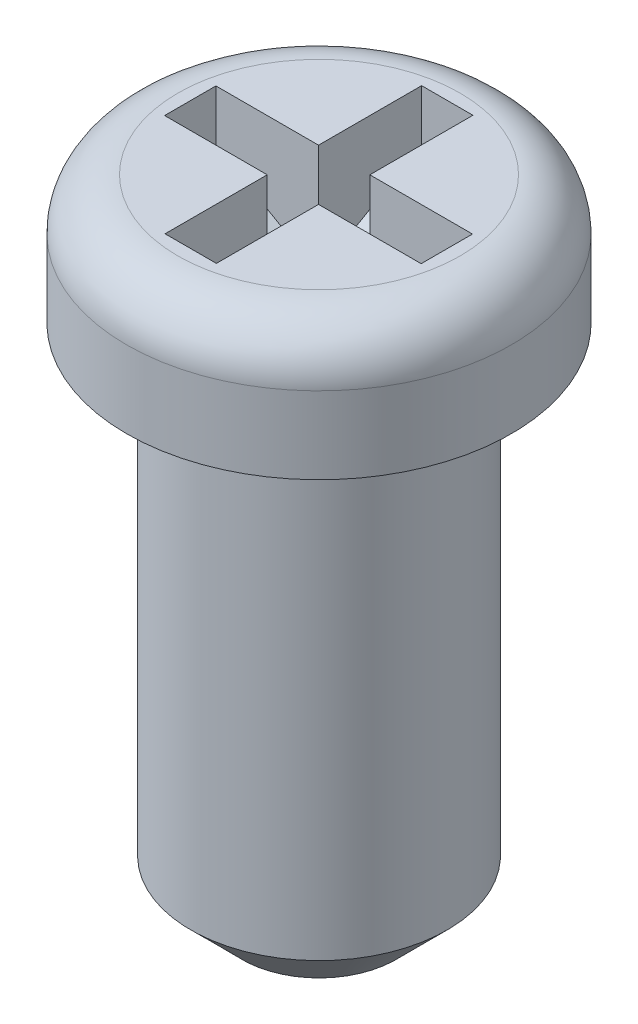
ISO-10303-21;
HEADER;
FILE_DESCRIPTION(('STEP AP214'),'2;1');
FILE_NAME('part.step','',(''),(''),'','','');
FILE_SCHEMA(('AUTOMOTIVE_DESIGN { 1 0 10303 214 1 1 1 1 }'));
ENDSEC;
DATA;
#1=APPLICATION_CONTEXT('core data for automotive mechanical design processes');
#2=APPLICATION_PROTOCOL_DEFINITION('international standard','automotive_design',2000,#1);
#3=PRODUCT_CONTEXT('',#1,'mechanical');
#4=PRODUCT('Part','Part','',(#3));
#5=PRODUCT_RELATED_PRODUCT_CATEGORY('part','',(#4));
#6=PRODUCT_DEFINITION_FORMATION('','',#4);
#7=PRODUCT_DEFINITION_CONTEXT('part definition',#1,'design');
#8=PRODUCT_DEFINITION('design','',#6,#7);
#9=PRODUCT_DEFINITION_SHAPE('','',#8);
#10=(LENGTH_UNIT() NAMED_UNIT(*) SI_UNIT(.MILLI.,.METRE.));
#11=(NAMED_UNIT(*) PLANE_ANGLE_UNIT() SI_UNIT($,.RADIAN.));
#12=(NAMED_UNIT(*) SI_UNIT($,.STERADIAN.) SOLID_ANGLE_UNIT());
#13=UNCERTAINTY_MEASURE_WITH_UNIT(LENGTH_MEASURE(1.E-05),#10,'distance_accuracy_value','');
#14=(GEOMETRIC_REPRESENTATION_CONTEXT(3) GLOBAL_UNCERTAINTY_ASSIGNED_CONTEXT((#13)) GLOBAL_UNIT_ASSIGNED_CONTEXT((#10,
#11,#12)) REPRESENTATION_CONTEXT('',''));
#15=CARTESIAN_POINT('',(0.,0.,0.));
#16=DIRECTION('',(0.,0.,1.));
#17=DIRECTION('',(1.,0.,0.));
#18=AXIS2_PLACEMENT_3D('',#15,#16,#17);
#19=CARTESIAN_POINT('',(1.5,-1.,0.));
#20=DIRECTION('',(0.,-1.,0.));
#21=DIRECTION('',(0.,0.,-1.));
#22=AXIS2_PLACEMENT_3D('',#19,#20,#21);
#23=PLANE('',#22);
#24=CARTESIAN_POINT('',(0.,-1.,0.));
#25=DIRECTION('',(0.,-1.,0.));
#26=DIRECTION('',(0.,0.,-1.));
#27=AXIS2_PLACEMENT_3D('',#24,#25,#26);
#28=CIRCLE('',#27,1.5);
#29=CARTESIAN_POINT('',(0.,-1.,-1.5));
#30=VERTEX_POINT('',#29);
#31=EDGE_CURVE('E300',#30,#30,#28,.T.);
#32=ORIENTED_EDGE('',*,*,#31,.T.);
#33=EDGE_LOOP('',(#32));
#34=FACE_BOUND('',#33,.T.);
#35=CARTESIAN_POINT('',(0.,-1.,0.));
#36=DIRECTION('',(0.,-1.,0.));
#37=DIRECTION('',(0.,0.,-1.));
#38=AXIS2_PLACEMENT_3D('',#35,#36,#37);
#39=CIRCLE('',#38,1.);
#40=CARTESIAN_POINT('',(0.,-1.,-1.));
#41=VERTEX_POINT('',#40);
#42=EDGE_CURVE('E252',#41,#41,#39,.T.);
#43=ORIENTED_EDGE('',*,*,#42,.F.);
#44=EDGE_LOOP('',(#43));
#45=FACE_BOUND('',#44,.T.);
#46=ADVANCED_FACE('F39',(#34,#45),#23,.T.);
#47=CARTESIAN_POINT('',(0.,-5.,0.));
#48=DIRECTION('',(0.,-1.,0.));
#49=DIRECTION('',(0.,0.,-1.));
#50=AXIS2_PLACEMENT_3D('',#47,#48,#49);
#51=CYLINDRICAL_SURFACE('',#50,1.5);
#52=CARTESIAN_POINT('',(0.,-0.4,0.));
#53=DIRECTION('',(0.,-1.,0.));
#54=DIRECTION('',(0.,0.,-1.));
#55=AXIS2_PLACEMENT_3D('',#52,#53,#54);
#56=CIRCLE('',#55,1.5);
#57=CARTESIAN_POINT('',(0.,-0.4,-1.5));
#58=VERTEX_POINT('',#57);
#59=EDGE_CURVE('E296',#58,#58,#56,.T.);
#60=ORIENTED_EDGE('',*,*,#59,.T.);
#61=EDGE_LOOP('',(#60));
#62=FACE_BOUND('',#61,.T.);
#63=ORIENTED_EDGE('',*,*,#31,.F.);
#64=EDGE_LOOP('',(#63));
#65=FACE_BOUND('',#64,.T.);
#66=ADVANCED_FACE('F404',(#62,#65),#51,.T.);
#67=CARTESIAN_POINT('',(0.,-0.4,0.));
#68=DIRECTION('',(0.,-1.,0.));
#69=DIRECTION('',(0.,0.,-1.));
#70=AXIS2_PLACEMENT_3D('',#67,#68,#69);
#71=TOROIDAL_SURFACE('',#70,1.1,0.4);
#72=CARTESIAN_POINT('',(0.,0.,0.));
#73=DIRECTION('',(0.,-1.,0.));
#74=DIRECTION('',(0.,0.,-1.));
#75=AXIS2_PLACEMENT_3D('',#72,#73,#74);
#76=CIRCLE('',#75,1.1);
#77=CARTESIAN_POINT('',(0.,0.,-1.1));
#78=VERTEX_POINT('',#77);
#79=EDGE_CURVE('E292',#78,#78,#76,.T.);
#80=ORIENTED_EDGE('',*,*,#79,.T.);
#81=EDGE_LOOP('',(#80));
#82=FACE_BOUND('',#81,.T.);
#83=ORIENTED_EDGE('',*,*,#59,.F.);
#84=EDGE_LOOP('',(#83));
#85=FACE_BOUND('',#84,.T.);
#86=ADVANCED_FACE('F410',(#82,#85),#71,.T.);
#87=CARTESIAN_POINT('',(0.,0.,0.));
#88=DIRECTION('',(0.,1.,0.));
#89=DIRECTION('',(0.,0.,1.));
#90=AXIS2_PLACEMENT_3D('',#87,#88,#89);
#91=PLANE('',#90);
#92=DIRECTION('',(0.,0.,1.));
#93=VECTOR('',#92,1.);
#94=CARTESIAN_POINT('',(-1.,0.,-0.196419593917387));
#95=LINE('',#94,#93);
#96=CARTESIAN_POINT('',(-1.,0.,-0.196419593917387));
#97=VERTEX_POINT('',#96);
#98=CARTESIAN_POINT('',(-1.,0.,0.203580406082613));
#99=VERTEX_POINT('',#98);
#100=EDGE_CURVE('E205',#97,#99,#95,.T.);
#101=ORIENTED_EDGE('',*,*,#100,.F.);
#102=DIRECTION('',(-1.,0.,0.));
#103=VECTOR('',#102,1.);
#104=CARTESIAN_POINT('',(-1.,0.,-0.196419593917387));
#105=LINE('',#104,#103);
#106=CARTESIAN_POINT('',(-0.2,0.,-0.196419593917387));
#107=VERTEX_POINT('',#106);
#108=EDGE_CURVE('E164',#107,#97,#105,.T.);
#109=ORIENTED_EDGE('',*,*,#108,.F.);
#110=DIRECTION('',(0.,0.,1.));
#111=VECTOR('',#110,1.);
#112=CARTESIAN_POINT('',(-0.2,0.,-1.));
#113=LINE('',#112,#111);
#114=CARTESIAN_POINT('',(-0.2,0.,-1.));
#115=VERTEX_POINT('',#114);
#116=EDGE_CURVE('E242',#115,#107,#113,.T.);
#117=ORIENTED_EDGE('',*,*,#116,.F.);
#118=DIRECTION('',(-1.,0.,0.));
#119=VECTOR('',#118,1.);
#120=CARTESIAN_POINT('',(-0.2,0.,-1.));
#121=LINE('',#120,#119);
#122=CARTESIAN_POINT('',(0.2,0.,-1.));
#123=VERTEX_POINT('',#122);
#124=EDGE_CURVE('E238',#123,#115,#121,.T.);
#125=ORIENTED_EDGE('',*,*,#124,.F.);
#126=DIRECTION('',(0.,0.,-1.));
#127=VECTOR('',#126,1.);
#128=CARTESIAN_POINT('',(0.2,0.,-1.));
#129=LINE('',#128,#127);
#130=CARTESIAN_POINT('',(0.2,0.,-0.196419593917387));
#131=VERTEX_POINT('',#130);
#132=EDGE_CURVE('E234',#131,#123,#129,.T.);
#133=ORIENTED_EDGE('',*,*,#132,.F.);
#134=DIRECTION('',(-1.,0.,0.));
#135=VECTOR('',#134,1.);
#136=CARTESIAN_POINT('',(0.2,0.,-0.196419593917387));
#137=LINE('',#136,#135);
#138=CARTESIAN_POINT('',(1.,0.,-0.196419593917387));
#139=VERTEX_POINT('',#138);
#140=EDGE_CURVE('E230',#139,#131,#137,.T.);
#141=ORIENTED_EDGE('',*,*,#140,.F.);
#142=DIRECTION('',(0.,0.,-1.));
#143=VECTOR('',#142,1.);
#144=CARTESIAN_POINT('',(1.,0.,-0.196419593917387));
#145=LINE('',#144,#143);
#146=CARTESIAN_POINT('',(1.,0.,0.203580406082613));
#147=VERTEX_POINT('',#146);
#148=EDGE_CURVE('E226',#147,#139,#145,.T.);
#149=ORIENTED_EDGE('',*,*,#148,.F.);
#150=DIRECTION('',(1.,0.,0.));
#151=VECTOR('',#150,1.);
#152=CARTESIAN_POINT('',(0.2,0.,0.203580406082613));
#153=LINE('',#152,#151);
#154=CARTESIAN_POINT('',(0.2,0.,0.203580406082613));
#155=VERTEX_POINT('',#154);
#156=EDGE_CURVE('E222',#155,#147,#153,.T.);
#157=ORIENTED_EDGE('',*,*,#156,.F.);
#158=DIRECTION('',(0.,0.,-1.));
#159=VECTOR('',#158,1.);
#160=CARTESIAN_POINT('',(0.2,0.,0.203580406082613));
#161=LINE('',#160,#159);
#162=CARTESIAN_POINT('',(0.2,0.,1.));
#163=VERTEX_POINT('',#162);
#164=EDGE_CURVE('E218',#163,#155,#161,.T.);
#165=ORIENTED_EDGE('',*,*,#164,.F.);
#166=DIRECTION('',(1.,0.,0.));
#167=VECTOR('',#166,1.);
#168=CARTESIAN_POINT('',(-0.2,0.,1.));
#169=LINE('',#168,#167);
#170=CARTESIAN_POINT('',(-0.2,0.,1.));
#171=VERTEX_POINT('',#170);
#172=EDGE_CURVE('E214',#171,#163,#169,.T.);
#173=ORIENTED_EDGE('',*,*,#172,.F.);
#174=DIRECTION('',(0.,0.,1.));
#175=VECTOR('',#174,1.);
#176=CARTESIAN_POINT('',(-0.2,0.,0.203580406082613));
#177=LINE('',#176,#175);
#178=CARTESIAN_POINT('',(-0.2,0.,0.203580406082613));
#179=VERTEX_POINT('',#178);
#180=EDGE_CURVE('E211',#179,#171,#177,.T.);
#181=ORIENTED_EDGE('',*,*,#180,.F.);
#182=DIRECTION('',(1.,0.,0.));
#183=VECTOR('',#182,1.);
#184=CARTESIAN_POINT('',(-1.,0.,0.203580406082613));
#185=LINE('',#184,#183);
#186=EDGE_CURVE('E170',#99,#179,#185,.T.);
#187=ORIENTED_EDGE('',*,*,#186,.F.);
#188=EDGE_LOOP('',(#101,#109,#117,#125,#133,#141,#149,#157,#165,#173,#181,#187));
#189=FACE_BOUND('',#188,.T.);
#190=ORIENTED_EDGE('',*,*,#79,.F.);
#191=EDGE_LOOP('',(#190));
#192=FACE_BOUND('',#191,.T.);
#193=ADVANCED_FACE('F368',(#189,#192),#91,.T.);
#194=CARTESIAN_POINT('',(0.6,-5.,0.));
#195=DIRECTION('',(0.,-1.,0.));
#196=DIRECTION('',(0.,0.,-1.));
#197=AXIS2_PLACEMENT_3D('',#194,#195,#196);
#198=PLANE('',#197);
#199=CARTESIAN_POINT('',(0.,-5.,0.));
#200=DIRECTION('',(0.,-1.,0.));
#201=DIRECTION('',(0.,0.,-1.));
#202=AXIS2_PLACEMENT_3D('',#199,#200,#201);
#203=CIRCLE('',#202,0.6);
#204=CARTESIAN_POINT('',(0.,-5.,-0.6));
#205=VERTEX_POINT('',#204);
#206=EDGE_CURVE('E288',#205,#205,#203,.T.);
#207=ORIENTED_EDGE('',*,*,#206,.T.);
#208=EDGE_LOOP('',(#207));
#209=FACE_BOUND('',#208,.T.);
#210=ADVANCED_FACE('F552',(#209),#198,.T.);
#211=CARTESIAN_POINT('',(0.,-5.,0.));
#212=DIRECTION('',(0.,1.,0.));
#213=DIRECTION('',(0.,0.,1.));
#214=AXIS2_PLACEMENT_3D('',#211,#212,#213);
#215=CONICAL_SURFACE('',#214,0.6,0.785398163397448);
#216=CARTESIAN_POINT('',(0.,-4.6,0.));
#217=DIRECTION('',(0.,-1.,0.));
#218=DIRECTION('',(0.,0.,-1.));
#219=AXIS2_PLACEMENT_3D('',#216,#217,#218);
#220=CIRCLE('',#219,1.);
#221=CARTESIAN_POINT('',(0.,-4.6,-1.));
#222=VERTEX_POINT('',#221);
#223=EDGE_CURVE('E284',#222,#222,#220,.T.);
#224=ORIENTED_EDGE('',*,*,#223,.T.);
#225=EDGE_LOOP('',(#224));
#226=FACE_BOUND('',#225,.T.);
#227=ORIENTED_EDGE('',*,*,#206,.F.);
#228=EDGE_LOOP('',(#227));
#229=FACE_BOUND('',#228,.T.);
#230=ADVANCED_FACE('F543',(#226,#229),#215,.T.);
#231=CARTESIAN_POINT('',(0.,-5.,0.));
#232=DIRECTION('',(0.,-1.,0.));
#233=DIRECTION('',(0.,0.,-1.));
#234=AXIS2_PLACEMENT_3D('',#231,#232,#233);
#235=CYLINDRICAL_SURFACE('',#234,1.);
#236=ORIENTED_EDGE('',*,*,#42,.T.);
#237=EDGE_LOOP('',(#236));
#238=FACE_BOUND('',#237,.T.);
#239=ORIENTED_EDGE('',*,*,#223,.F.);
#240=EDGE_LOOP('',(#239));
#241=FACE_BOUND('',#240,.T.);
#242=ADVANCED_FACE('F534',(#238,#241),#235,.T.);
#243=CARTESIAN_POINT('',(-1.,-0.8,-0.196419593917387));
#244=DIRECTION('',(-1.,0.,0.));
#245=DIRECTION('',(0.,0.,1.));
#246=AXIS2_PLACEMENT_3D('',#243,#244,#245);
#247=PLANE('',#246);
#248=DIRECTION('',(0.,1.,0.));
#249=VECTOR('',#248,1.);
#250=CARTESIAN_POINT('',(-1.,-0.8,0.203580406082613));
#251=LINE('',#250,#249);
#252=CARTESIAN_POINT('',(-1.,-0.400000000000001,0.203580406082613));
#253=VERTEX_POINT('',#252);
#254=EDGE_CURVE('E176',#253,#99,#251,.T.);
#255=ORIENTED_EDGE('',*,*,#254,.F.);
#256=DIRECTION('',(0.,0.,-1.));
#257=VECTOR('',#256,1.);
#258=CARTESIAN_POINT('',(-1.,-0.400000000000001,-0.196419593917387));
#259=LINE('',#258,#257);
#260=CARTESIAN_POINT('',(-1.,-0.400000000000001,-0.196419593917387));
#261=VERTEX_POINT('',#260);
#262=EDGE_CURVE('E320',#253,#261,#259,.T.);
#263=ORIENTED_EDGE('',*,*,#262,.T.);
#264=DIRECTION('',(0.,1.,0.));
#265=VECTOR('',#264,1.);
#266=CARTESIAN_POINT('',(-1.,-0.8,-0.196419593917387));
#267=LINE('',#266,#265);
#268=EDGE_CURVE('E249',#261,#97,#267,.T.);
#269=ORIENTED_EDGE('',*,*,#268,.T.);
#270=ORIENTED_EDGE('',*,*,#100,.T.);
#271=EDGE_LOOP('',(#255,#263,#269,#270));
#272=FACE_BOUND('',#271,.T.);
#273=ADVANCED_FACE('F380',(#272),#247,.F.);
#274=CARTESIAN_POINT('',(-1.,-0.8,-0.196419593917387));
#275=DIRECTION('',(0.,0.,-1.));
#276=DIRECTION('',(-1.,0.,0.));
#277=AXIS2_PLACEMENT_3D('',#274,#275,#276);
#278=PLANE('',#277);
#279=ORIENTED_EDGE('',*,*,#268,.F.);
#280=DIRECTION('',(0.866025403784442,-0.499999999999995,0.));
#281=VECTOR('',#280,1.);
#282=CARTESIAN_POINT('',(-0.307179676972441,-0.8,-0.196419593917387));
#283=LINE('',#282,#281);
#284=CARTESIAN_POINT('',(-0.307179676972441,-0.8,-0.196419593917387));
#285=VERTEX_POINT('',#284);
#286=EDGE_CURVE('E323',#261,#285,#283,.T.);
#287=ORIENTED_EDGE('',*,*,#286,.T.);
#288=DIRECTION('',(-1.,0.,0.));
#289=VECTOR('',#288,1.);
#290=CARTESIAN_POINT('',(-1.,-0.8,-0.196419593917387));
#291=LINE('',#290,#289);
#292=CARTESIAN_POINT('',(-0.2,-0.8,-0.196419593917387));
#293=VERTEX_POINT('',#292);
#294=EDGE_CURVE('E202',#293,#285,#291,.T.);
#295=ORIENTED_EDGE('',*,*,#294,.F.);
#296=DIRECTION('',(0.,1.,0.));
#297=VECTOR('',#296,1.);
#298=CARTESIAN_POINT('',(-0.2,-0.8,-0.196419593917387));
#299=LINE('',#298,#297);
#300=EDGE_CURVE('E253',#293,#107,#299,.T.);
#301=ORIENTED_EDGE('',*,*,#300,.T.);
#302=ORIENTED_EDGE('',*,*,#108,.T.);
#303=EDGE_LOOP('',(#279,#287,#295,#301,#302));
#304=FACE_BOUND('',#303,.T.);
#305=ADVANCED_FACE('F373',(#304),#278,.F.);
#306=CARTESIAN_POINT('',(-0.2,-0.8,-1.));
#307=DIRECTION('',(-1.,0.,0.));
#308=DIRECTION('',(0.,0.,1.));
#309=AXIS2_PLACEMENT_3D('',#306,#307,#308);
#310=PLANE('',#309);
#311=DIRECTION('',(0.,0.,1.));
#312=VECTOR('',#311,1.);
#313=CARTESIAN_POINT('',(-0.2,-0.8,-1.));
#314=LINE('',#313,#312);
#315=CARTESIAN_POINT('',(-0.2,-0.8,-0.307179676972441));
#316=VERTEX_POINT('',#315);
#317=EDGE_CURVE('E199',#316,#293,#314,.T.);
#318=ORIENTED_EDGE('',*,*,#317,.F.);
#319=DIRECTION('',(0.,0.499999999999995,-0.866025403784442));
#320=VECTOR('',#319,1.);
#321=CARTESIAN_POINT('',(-0.2,-0.8,-0.307179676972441));
#322=LINE('',#321,#320);
#323=CARTESIAN_POINT('',(-0.2,-0.400000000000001,-1.));
#324=VERTEX_POINT('',#323);
#325=EDGE_CURVE('E334',#316,#324,#322,.T.);
#326=ORIENTED_EDGE('',*,*,#325,.T.);
#327=DIRECTION('',(0.,1.,0.));
#328=VECTOR('',#327,1.);
#329=CARTESIAN_POINT('',(-0.2,-0.8,-1.));
#330=LINE('',#329,#328);
#331=EDGE_CURVE('E256',#324,#115,#330,.T.);
#332=ORIENTED_EDGE('',*,*,#331,.T.);
#333=ORIENTED_EDGE('',*,*,#116,.T.);
#334=ORIENTED_EDGE('',*,*,#300,.F.);
#335=EDGE_LOOP('',(#318,#326,#332,#333,#334));
#336=FACE_BOUND('',#335,.T.);
#337=ADVANCED_FACE('F358',(#336),#310,.F.);
#338=CARTESIAN_POINT('',(-0.2,-0.8,-1.));
#339=DIRECTION('',(0.,0.,-1.));
#340=DIRECTION('',(-1.,0.,0.));
#341=AXIS2_PLACEMENT_3D('',#338,#339,#340);
#342=PLANE('',#341);
#343=ORIENTED_EDGE('',*,*,#331,.F.);
#344=DIRECTION('',(1.,0.,0.));
#345=VECTOR('',#344,1.);
#346=CARTESIAN_POINT('',(-0.2,-0.400000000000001,-1.));
#347=LINE('',#346,#345);
#348=CARTESIAN_POINT('',(0.2,-0.400000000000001,-1.));
#349=VERTEX_POINT('',#348);
#350=EDGE_CURVE('E337',#324,#349,#347,.T.);
#351=ORIENTED_EDGE('',*,*,#350,.T.);
#352=DIRECTION('',(0.,1.,0.));
#353=VECTOR('',#352,1.);
#354=CARTESIAN_POINT('',(0.2,-0.8,-1.));
#355=LINE('',#354,#353);
#356=EDGE_CURVE('E259',#349,#123,#355,.T.);
#357=ORIENTED_EDGE('',*,*,#356,.T.);
#358=ORIENTED_EDGE('',*,*,#124,.T.);
#359=EDGE_LOOP('',(#343,#351,#357,#358));
#360=FACE_BOUND('',#359,.T.);
#361=ADVANCED_FACE('F361',(#360),#342,.F.);
#362=CARTESIAN_POINT('',(0.2,-0.8,-1.));
#363=DIRECTION('',(1.,0.,0.));
#364=DIRECTION('',(0.,0.,-1.));
#365=AXIS2_PLACEMENT_3D('',#362,#363,#364);
#366=PLANE('',#365);
#367=ORIENTED_EDGE('',*,*,#356,.F.);
#368=DIRECTION('',(0.,-0.499999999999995,0.866025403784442));
#369=VECTOR('',#368,1.);
#370=CARTESIAN_POINT('',(0.2,-0.8,-0.307179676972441));
#371=LINE('',#370,#369);
#372=CARTESIAN_POINT('',(0.2,-0.8,-0.307179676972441));
#373=VERTEX_POINT('',#372);
#374=EDGE_CURVE('E340',#349,#373,#371,.T.);
#375=ORIENTED_EDGE('',*,*,#374,.T.);
#376=DIRECTION('',(0.,0.,-1.));
#377=VECTOR('',#376,1.);
#378=CARTESIAN_POINT('',(0.2,-0.8,-1.));
#379=LINE('',#378,#377);
#380=CARTESIAN_POINT('',(0.2,-0.8,-0.196419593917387));
#381=VERTEX_POINT('',#380);
#382=EDGE_CURVE('E195',#381,#373,#379,.T.);
#383=ORIENTED_EDGE('',*,*,#382,.F.);
#384=DIRECTION('',(0.,1.,0.));
#385=VECTOR('',#384,1.);
#386=CARTESIAN_POINT('',(0.2,-0.8,-0.196419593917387));
#387=LINE('',#386,#385);
#388=EDGE_CURVE('E262',#381,#131,#387,.T.);
#389=ORIENTED_EDGE('',*,*,#388,.T.);
#390=ORIENTED_EDGE('',*,*,#132,.T.);
#391=EDGE_LOOP('',(#367,#375,#383,#389,#390));
#392=FACE_BOUND('',#391,.T.);
#393=ADVANCED_FACE('F349',(#392),#366,.F.);
#394=CARTESIAN_POINT('',(0.2,-0.8,-0.196419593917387));
#395=DIRECTION('',(0.,0.,-1.));
#396=DIRECTION('',(-1.,0.,0.));
#397=AXIS2_PLACEMENT_3D('',#394,#395,#396);
#398=PLANE('',#397);
#399=DIRECTION('',(-1.,0.,0.));
#400=VECTOR('',#399,1.);
#401=CARTESIAN_POINT('',(0.2,-0.8,-0.196419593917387));
#402=LINE('',#401,#400);
#403=CARTESIAN_POINT('',(0.307179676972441,-0.8,-0.196419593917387));
#404=VERTEX_POINT('',#403);
#405=EDGE_CURVE('E192',#404,#381,#402,.T.);
#406=ORIENTED_EDGE('',*,*,#405,.F.);
#407=DIRECTION('',(0.866025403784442,0.499999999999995,0.));
#408=VECTOR('',#407,1.);
#409=CARTESIAN_POINT('',(0.307179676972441,-0.8,-0.196419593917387));
#410=LINE('',#409,#408);
#411=CARTESIAN_POINT('',(1.,-0.400000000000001,-0.196419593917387));
#412=VERTEX_POINT('',#411);
#413=EDGE_CURVE('E62',#404,#412,#410,.T.);
#414=ORIENTED_EDGE('',*,*,#413,.T.);
#415=DIRECTION('',(0.,1.,0.));
#416=VECTOR('',#415,1.);
#417=CARTESIAN_POINT('',(1.,-0.8,-0.196419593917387));
#418=LINE('',#417,#416);
#419=EDGE_CURVE('E265',#412,#139,#418,.T.);
#420=ORIENTED_EDGE('',*,*,#419,.T.);
#421=ORIENTED_EDGE('',*,*,#140,.T.);
#422=ORIENTED_EDGE('',*,*,#388,.F.);
#423=EDGE_LOOP('',(#406,#414,#420,#421,#422));
#424=FACE_BOUND('',#423,.T.);
#425=ADVANCED_FACE('F491',(#424),#398,.F.);
#426=CARTESIAN_POINT('',(1.,-0.8,-0.196419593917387));
#427=DIRECTION('',(1.,0.,0.));
#428=DIRECTION('',(0.,0.,-1.));
#429=AXIS2_PLACEMENT_3D('',#426,#427,#428);
#430=PLANE('',#429);
#431=ORIENTED_EDGE('',*,*,#419,.F.);
#432=DIRECTION('',(0.,0.,1.));
#433=VECTOR('',#432,1.);
#434=CARTESIAN_POINT('',(1.,-0.400000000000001,-0.196419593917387));
#435=LINE('',#434,#433);
#436=CARTESIAN_POINT('',(1.,-0.400000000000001,0.203580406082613));
#437=VERTEX_POINT('',#436);
#438=EDGE_CURVE('E48',#412,#437,#435,.T.);
#439=ORIENTED_EDGE('',*,*,#438,.T.);
#440=DIRECTION('',(0.,1.,0.));
#441=VECTOR('',#440,1.);
#442=CARTESIAN_POINT('',(1.,-0.8,0.203580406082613));
#443=LINE('',#442,#441);
#444=EDGE_CURVE('E268',#437,#147,#443,.T.);
#445=ORIENTED_EDGE('',*,*,#444,.T.);
#446=ORIENTED_EDGE('',*,*,#148,.T.);
#447=EDGE_LOOP('',(#431,#439,#445,#446));
#448=FACE_BOUND('',#447,.T.);
#449=ADVANCED_FACE('F483',(#448),#430,.F.);
#450=CARTESIAN_POINT('',(0.2,-0.8,0.203580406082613));
#451=DIRECTION('',(0.,0.,1.));
#452=DIRECTION('',(1.,0.,0.));
#453=AXIS2_PLACEMENT_3D('',#450,#451,#452);
#454=PLANE('',#453);
#455=ORIENTED_EDGE('',*,*,#444,.F.);
#456=DIRECTION('',(-0.866025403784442,-0.499999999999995,0.));
#457=VECTOR('',#456,1.);
#458=CARTESIAN_POINT('',(0.307179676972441,-0.8,0.203580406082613));
#459=LINE('',#458,#457);
#460=CARTESIAN_POINT('',(0.307179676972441,-0.8,0.203580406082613));
#461=VERTEX_POINT('',#460);
#462=EDGE_CURVE('E11',#437,#461,#459,.T.);
#463=ORIENTED_EDGE('',*,*,#462,.T.);
#464=DIRECTION('',(1.,0.,0.));
#465=VECTOR('',#464,1.);
#466=CARTESIAN_POINT('',(0.2,-0.8,0.203580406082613));
#467=LINE('',#466,#465);
#468=CARTESIAN_POINT('',(0.2,-0.8,0.203580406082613));
#469=VERTEX_POINT('',#468);
#470=EDGE_CURVE('E186',#469,#461,#467,.T.);
#471=ORIENTED_EDGE('',*,*,#470,.F.);
#472=DIRECTION('',(0.,1.,0.));
#473=VECTOR('',#472,1.);
#474=CARTESIAN_POINT('',(0.2,-0.8,0.203580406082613));
#475=LINE('',#474,#473);
#476=EDGE_CURVE('E271',#469,#155,#475,.T.);
#477=ORIENTED_EDGE('',*,*,#476,.T.);
#478=ORIENTED_EDGE('',*,*,#156,.T.);
#479=EDGE_LOOP('',(#455,#463,#471,#477,#478));
#480=FACE_BOUND('',#479,.T.);
#481=ADVANCED_FACE('F395',(#480),#454,.F.);
#482=CARTESIAN_POINT('',(0.2,-0.8,0.203580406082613));
#483=DIRECTION('',(1.,0.,0.));
#484=DIRECTION('',(0.,0.,-1.));
#485=AXIS2_PLACEMENT_3D('',#482,#483,#484);
#486=PLANE('',#485);
#487=DIRECTION('',(0.,0.,-1.));
#488=VECTOR('',#487,1.);
#489=CARTESIAN_POINT('',(0.2,-0.8,0.203580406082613));
#490=LINE('',#489,#488);
#491=CARTESIAN_POINT('',(0.2,-0.8,0.307179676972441));
#492=VERTEX_POINT('',#491);
#493=EDGE_CURVE('E183',#492,#469,#490,.T.);
#494=ORIENTED_EDGE('',*,*,#493,.F.);
#495=DIRECTION('',(0.,0.499999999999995,0.866025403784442));
#496=VECTOR('',#495,1.);
#497=CARTESIAN_POINT('',(0.2,-0.8,0.307179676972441));
#498=LINE('',#497,#496);
#499=CARTESIAN_POINT('',(0.2,-0.400000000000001,1.));
#500=VERTEX_POINT('',#499);
#501=EDGE_CURVE('E326',#492,#500,#498,.T.);
#502=ORIENTED_EDGE('',*,*,#501,.T.);
#503=DIRECTION('',(0.,1.,0.));
#504=VECTOR('',#503,1.);
#505=CARTESIAN_POINT('',(0.2,-0.8,1.));
#506=LINE('',#505,#504);
#507=EDGE_CURVE('E274',#500,#163,#506,.T.);
#508=ORIENTED_EDGE('',*,*,#507,.T.);
#509=ORIENTED_EDGE('',*,*,#164,.T.);
#510=ORIENTED_EDGE('',*,*,#476,.F.);
#511=EDGE_LOOP('',(#494,#502,#508,#509,#510));
#512=FACE_BOUND('',#511,.T.);
#513=ADVANCED_FACE('F390',(#512),#486,.F.);
#514=CARTESIAN_POINT('',(-0.2,-0.8,1.));
#515=DIRECTION('',(0.,0.,1.));
#516=DIRECTION('',(1.,0.,0.));
#517=AXIS2_PLACEMENT_3D('',#514,#515,#516);
#518=PLANE('',#517);
#519=ORIENTED_EDGE('',*,*,#507,.F.);
#520=DIRECTION('',(-1.,0.,0.));
#521=VECTOR('',#520,1.);
#522=CARTESIAN_POINT('',(-0.2,-0.400000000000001,1.));
#523=LINE('',#522,#521);
#524=CARTESIAN_POINT('',(-0.2,-0.400000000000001,1.));
#525=VERTEX_POINT('',#524);
#526=EDGE_CURVE('E329',#500,#525,#523,.T.);
#527=ORIENTED_EDGE('',*,*,#526,.T.);
#528=DIRECTION('',(0.,1.,0.));
#529=VECTOR('',#528,1.);
#530=CARTESIAN_POINT('',(-0.2,-0.8,1.));
#531=LINE('',#530,#529);
#532=EDGE_CURVE('E175',#525,#171,#531,.T.);
#533=ORIENTED_EDGE('',*,*,#532,.T.);
#534=ORIENTED_EDGE('',*,*,#172,.T.);
#535=EDGE_LOOP('',(#519,#527,#533,#534));
#536=FACE_BOUND('',#535,.T.);
#537=ADVANCED_FACE('F461',(#536),#518,.F.);
#538=CARTESIAN_POINT('',(-0.2,-0.8,0.203580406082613));
#539=DIRECTION('',(-1.,0.,0.));
#540=DIRECTION('',(0.,0.,1.));
#541=AXIS2_PLACEMENT_3D('',#538,#539,#540);
#542=PLANE('',#541);
#543=ORIENTED_EDGE('',*,*,#532,.F.);
#544=DIRECTION('',(0.,-0.499999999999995,-0.866025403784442));
#545=VECTOR('',#544,1.);
#546=CARTESIAN_POINT('',(-0.2,-0.8,0.307179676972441));
#547=LINE('',#546,#545);
#548=CARTESIAN_POINT('',(-0.2,-0.8,0.307179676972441));
#549=VERTEX_POINT('',#548);
#550=EDGE_CURVE('E181',#525,#549,#547,.T.);
#551=ORIENTED_EDGE('',*,*,#550,.T.);
#552=DIRECTION('',(0.,0.,1.));
#553=VECTOR('',#552,1.);
#554=CARTESIAN_POINT('',(-0.2,-0.8,0.203580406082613));
#555=LINE('',#554,#553);
#556=CARTESIAN_POINT('',(-0.2,-0.8,0.203580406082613));
#557=VERTEX_POINT('',#556);
#558=EDGE_CURVE('E158',#557,#549,#555,.T.);
#559=ORIENTED_EDGE('',*,*,#558,.F.);
#560=DIRECTION('',(0.,1.,0.));
#561=VECTOR('',#560,1.);
#562=CARTESIAN_POINT('',(-0.2,-0.8,0.203580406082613));
#563=LINE('',#562,#561);
#564=EDGE_CURVE('E167',#557,#179,#563,.T.);
#565=ORIENTED_EDGE('',*,*,#564,.T.);
#566=ORIENTED_EDGE('',*,*,#180,.T.);
#567=EDGE_LOOP('',(#543,#551,#559,#565,#566));
#568=FACE_BOUND('',#567,.T.);
#569=ADVANCED_FACE('F179',(#568),#542,.F.);
#570=CARTESIAN_POINT('',(-1.,-0.8,0.203580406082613));
#571=DIRECTION('',(0.,0.,1.));
#572=DIRECTION('',(1.,0.,0.));
#573=AXIS2_PLACEMENT_3D('',#570,#571,#572);
#574=PLANE('',#573);
#575=DIRECTION('',(1.,0.,0.));
#576=VECTOR('',#575,1.);
#577=CARTESIAN_POINT('',(-1.,-0.8,0.203580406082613));
#578=LINE('',#577,#576);
#579=CARTESIAN_POINT('',(-0.307179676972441,-0.8,0.203580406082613));
#580=VERTEX_POINT('',#579);
#581=EDGE_CURVE('E152',#580,#557,#578,.T.);
#582=ORIENTED_EDGE('',*,*,#581,.F.);
#583=DIRECTION('',(-0.866025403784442,0.499999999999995,0.));
#584=VECTOR('',#583,1.);
#585=CARTESIAN_POINT('',(-0.307179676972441,-0.8,0.203580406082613));
#586=LINE('',#585,#584);
#587=EDGE_CURVE('E317',#580,#253,#586,.T.);
#588=ORIENTED_EDGE('',*,*,#587,.T.);
#589=ORIENTED_EDGE('',*,*,#254,.T.);
#590=ORIENTED_EDGE('',*,*,#186,.T.);
#591=ORIENTED_EDGE('',*,*,#564,.F.);
#592=EDGE_LOOP('',(#582,#588,#589,#590,#591));
#593=FACE_BOUND('',#592,.T.);
#594=ADVANCED_FACE('F168',(#593),#574,.F.);
#595=CARTESIAN_POINT('',(0.,-0.8,0.));
#596=DIRECTION('',(0.,1.,0.));
#597=DIRECTION('',(0.,0.,1.));
#598=AXIS2_PLACEMENT_3D('',#595,#596,#597);
#599=PLANE('',#598);
#600=ORIENTED_EDGE('',*,*,#294,.T.);
#601=DIRECTION('',(0.,0.,1.));
#602=VECTOR('',#601,1.);
#603=CARTESIAN_POINT('',(-0.307179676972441,-0.8,0.));
#604=LINE('',#603,#602);
#605=EDGE_CURVE('E161',#285,#580,#604,.T.);
#606=ORIENTED_EDGE('',*,*,#605,.T.);
#607=ORIENTED_EDGE('',*,*,#581,.T.);
#608=ORIENTED_EDGE('',*,*,#558,.T.);
#609=DIRECTION('',(1.,0.,0.));
#610=VECTOR('',#609,1.);
#611=CARTESIAN_POINT('',(0.,-0.8,0.307179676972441));
#612=LINE('',#611,#610);
#613=EDGE_CURVE('E312',#549,#492,#612,.T.);
#614=ORIENTED_EDGE('',*,*,#613,.T.);
#615=ORIENTED_EDGE('',*,*,#493,.T.);
#616=ORIENTED_EDGE('',*,*,#470,.T.);
#617=DIRECTION('',(0.,0.,-1.));
#618=VECTOR('',#617,1.);
#619=CARTESIAN_POINT('',(0.307179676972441,-0.8,0.));
#620=LINE('',#619,#618);
#621=EDGE_CURVE('E304',#461,#404,#620,.T.);
#622=ORIENTED_EDGE('',*,*,#621,.T.);
#623=ORIENTED_EDGE('',*,*,#405,.T.);
#624=ORIENTED_EDGE('',*,*,#382,.T.);
#625=DIRECTION('',(-1.,0.,0.));
#626=VECTOR('',#625,1.);
#627=CARTESIAN_POINT('',(0.,-0.8,-0.307179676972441));
#628=LINE('',#627,#626);
#629=EDGE_CURVE('E308',#373,#316,#628,.T.);
#630=ORIENTED_EDGE('',*,*,#629,.T.);
#631=ORIENTED_EDGE('',*,*,#317,.T.);
#632=EDGE_LOOP('',(#600,#606,#607,#608,#614,#615,#616,#622,#623,#624,#630,#631));
#633=FACE_BOUND('',#632,.T.);
#634=ADVANCED_FACE('F155',(#633),#599,.T.);
#635=CARTESIAN_POINT('',(-0.307179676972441,-0.8,0.));
#636=DIRECTION('',(-0.499999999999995,-0.866025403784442,0.));
#637=DIRECTION('',(0.,0.,1.));
#638=AXIS2_PLACEMENT_3D('',#635,#636,#637);
#639=PLANE('',#638);
#640=ORIENTED_EDGE('',*,*,#286,.F.);
#641=ORIENTED_EDGE('',*,*,#262,.F.);
#642=ORIENTED_EDGE('',*,*,#587,.F.);
#643=ORIENTED_EDGE('',*,*,#605,.F.);
#644=EDGE_LOOP('',(#640,#641,#642,#643));
#645=FACE_BOUND('',#644,.T.);
#646=ADVANCED_FACE('F376',(#645),#639,.F.);
#647=CARTESIAN_POINT('',(0.,-0.8,0.307179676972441));
#648=DIRECTION('',(0.,-0.866025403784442,0.499999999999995));
#649=DIRECTION('',(1.,0.,0.));
#650=AXIS2_PLACEMENT_3D('',#647,#648,#649);
#651=PLANE('',#650);
#652=ORIENTED_EDGE('',*,*,#550,.F.);
#653=ORIENTED_EDGE('',*,*,#526,.F.);
#654=ORIENTED_EDGE('',*,*,#501,.F.);
#655=ORIENTED_EDGE('',*,*,#613,.F.);
#656=EDGE_LOOP('',(#652,#653,#654,#655));
#657=FACE_BOUND('',#656,.T.);
#658=ADVANCED_FACE('F386',(#657),#651,.F.);
#659=CARTESIAN_POINT('',(0.,-0.8,-0.307179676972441));
#660=DIRECTION('',(0.,-0.866025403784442,-0.499999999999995));
#661=DIRECTION('',(-1.,0.,0.));
#662=AXIS2_PLACEMENT_3D('',#659,#660,#661);
#663=PLANE('',#662);
#664=ORIENTED_EDGE('',*,*,#374,.F.);
#665=ORIENTED_EDGE('',*,*,#350,.F.);
#666=ORIENTED_EDGE('',*,*,#325,.F.);
#667=ORIENTED_EDGE('',*,*,#629,.F.);
#668=EDGE_LOOP('',(#664,#665,#666,#667));
#669=FACE_BOUND('',#668,.T.);
#670=ADVANCED_FACE('F355',(#669),#663,.F.);
#671=CARTESIAN_POINT('',(0.307179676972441,-0.8,0.));
#672=DIRECTION('',(0.499999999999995,-0.866025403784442,0.));
#673=DIRECTION('',(0.,0.,-1.));
#674=AXIS2_PLACEMENT_3D('',#671,#672,#673);
#675=PLANE('',#674);
#676=ORIENTED_EDGE('',*,*,#462,.F.);
#677=ORIENTED_EDGE('',*,*,#438,.F.);
#678=ORIENTED_EDGE('',*,*,#413,.F.);
#679=ORIENTED_EDGE('',*,*,#621,.F.);
#680=EDGE_LOOP('',(#676,#677,#678,#679));
#681=FACE_BOUND('',#680,.T.);
#682=ADVANCED_FACE('F41',(#681),#675,.F.);
#683=CLOSED_SHELL('',(#46,#66,#86,#193,#210,#230,#242,#273,#305,#337,#361,#393,#425,#449,#481,
#513,#537,#569,#594,#634,#646,#658,#670,#682));
#684=MANIFOLD_SOLID_BREP('B2',#683);
#685=ADVANCED_BREP_SHAPE_REPRESENTATION('',(#18,#684),#14);
#686=SHAPE_DEFINITION_REPRESENTATION(#9,#685);
ENDSEC;
END-ISO-10303-21;
